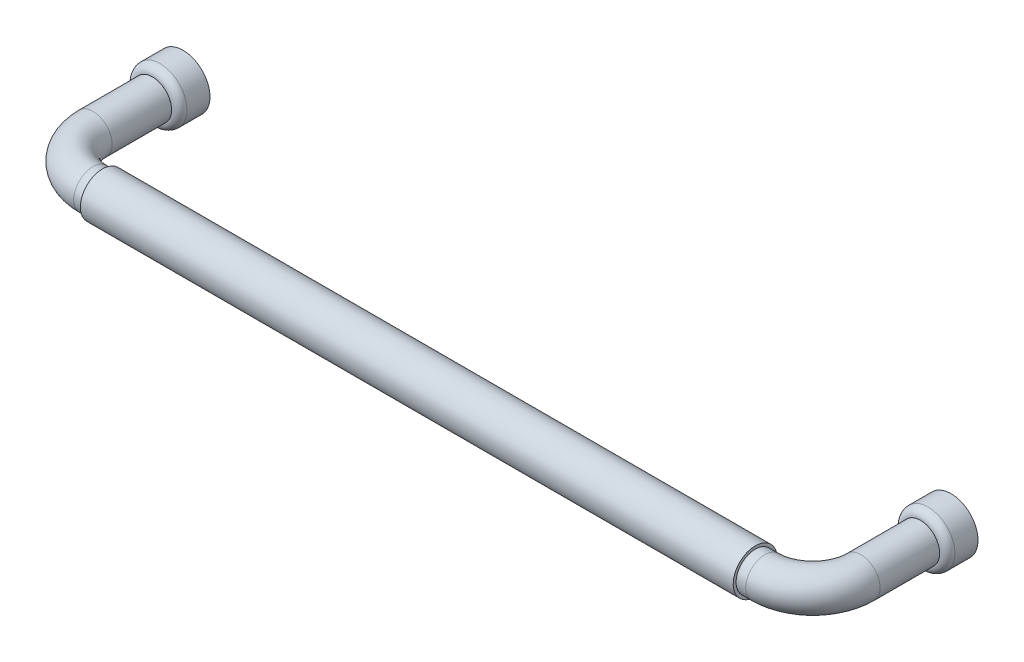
ISO-10303-21;
HEADER;
FILE_DESCRIPTION(('STEP AP214'),'2;1');
FILE_NAME('part.step','',(''),(''),'','','');
FILE_SCHEMA(('AUTOMOTIVE_DESIGN { 1 0 10303 214 1 1 1 1 }'));
ENDSEC;
DATA;
#1=APPLICATION_CONTEXT('core data for automotive mechanical design processes');
#2=APPLICATION_PROTOCOL_DEFINITION('international standard','automotive_design',2000,#1);
#3=PRODUCT_CONTEXT('',#1,'mechanical');
#4=PRODUCT('Part','Part','',(#3));
#5=PRODUCT_RELATED_PRODUCT_CATEGORY('part','',(#4));
#6=PRODUCT_DEFINITION_FORMATION('','',#4);
#7=PRODUCT_DEFINITION_CONTEXT('part definition',#1,'design');
#8=PRODUCT_DEFINITION('design','',#6,#7);
#9=PRODUCT_DEFINITION_SHAPE('','',#8);
#10=(LENGTH_UNIT() NAMED_UNIT(*) SI_UNIT(.MILLI.,.METRE.));
#11=(NAMED_UNIT(*) PLANE_ANGLE_UNIT() SI_UNIT($,.RADIAN.));
#12=(NAMED_UNIT(*) SI_UNIT($,.STERADIAN.) SOLID_ANGLE_UNIT());
#13=UNCERTAINTY_MEASURE_WITH_UNIT(LENGTH_MEASURE(1.E-05),#10,'distance_accuracy_value','');
#14=(GEOMETRIC_REPRESENTATION_CONTEXT(3) GLOBAL_UNCERTAINTY_ASSIGNED_CONTEXT((#13)) GLOBAL_UNIT_ASSIGNED_CONTEXT((#10,
#11,#12)) REPRESENTATION_CONTEXT('',''));
#15=CARTESIAN_POINT('',(0.,0.,0.));
#16=DIRECTION('',(0.,0.,1.));
#17=DIRECTION('',(1.,0.,0.));
#18=AXIS2_PLACEMENT_3D('',#15,#16,#17);
#19=CARTESIAN_POINT('',(0.,0.,0.));
#20=DIRECTION('',(0.,0.,-1.));
#21=DIRECTION('',(0.,1.,0.));
#22=AXIS2_PLACEMENT_3D('',#19,#20,#21);
#23=PLANE('',#22);
#24=CARTESIAN_POINT('',(0.,0.,0.));
#25=DIRECTION('',(0.,0.,1.));
#26=DIRECTION('',(0.,-1.,0.));
#27=AXIS2_PLACEMENT_3D('',#24,#25,#26);
#28=CIRCLE('',#27,7.00045758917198);
#29=CARTESIAN_POINT('',(0.,-7.00045758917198,0.));
#30=VERTEX_POINT('',#29);
#31=EDGE_CURVE('E295',#30,#30,#28,.T.);
#32=ORIENTED_EDGE('',*,*,#31,.F.);
#33=EDGE_LOOP('',(#32));
#34=FACE_BOUND('',#33,.T.);
#35=CARTESIAN_POINT('',(0.,0.,0.));
#36=DIRECTION('',(0.,0.,1.));
#37=DIRECTION('',(0.,-1.,0.));
#38=AXIS2_PLACEMENT_3D('',#35,#36,#37);
#39=CIRCLE('',#38,2.5);
#40=CARTESIAN_POINT('',(0.,-2.5,0.));
#41=VERTEX_POINT('',#40);
#42=EDGE_CURVE('E285',#41,#41,#39,.T.);
#43=ORIENTED_EDGE('',*,*,#42,.T.);
#44=EDGE_LOOP('',(#43));
#45=FACE_BOUND('',#44,.T.);
#46=ADVANCED_FACE('F12',(#34,#45),#23,.T.);
#47=CARTESIAN_POINT('',(187.5,0.,36.));
#48=DIRECTION('',(-1.,0.,0.));
#49=DIRECTION('',(0.,0.,1.));
#50=AXIS2_PLACEMENT_3D('',#47,#48,#49);
#51=CYLINDRICAL_SURFACE('',#50,5.);
#52=CARTESIAN_POINT('',(185.,0.,36.));
#53=DIRECTION('',(1.,0.,0.));
#54=DIRECTION('',(0.,1.,0.));
#55=AXIS2_PLACEMENT_3D('',#52,#53,#54);
#56=CIRCLE('',#55,5.);
#57=CARTESIAN_POINT('',(185.,5.,36.));
#58=VERTEX_POINT('',#57);
#59=EDGE_CURVE('E19',#58,#58,#56,.F.);
#60=ORIENTED_EDGE('',*,*,#59,.F.);
#61=EDGE_LOOP('',(#60));
#62=FACE_BOUND('',#61,.T.);
#63=CARTESIAN_POINT('',(187.5,0.,36.));
#64=DIRECTION('',(-1.,0.,0.));
#65=DIRECTION('',(0.,1.,0.));
#66=AXIS2_PLACEMENT_3D('',#63,#64,#65);
#67=CIRCLE('',#66,5.);
#68=CARTESIAN_POINT('',(187.5,0.,41.));
#69=VERTEX_POINT('',#68);
#70=EDGE_CURVE('E55',#69,#69,#67,.T.);
#71=ORIENTED_EDGE('',*,*,#70,.T.);
#72=EDGE_LOOP('',(#71));
#73=FACE_BOUND('',#72,.T.);
#74=ADVANCED_FACE('F77',(#62,#73),#51,.T.);
#75=CARTESIAN_POINT('',(187.5,0.,23.5));
#76=DIRECTION('',(0.,-1.,0.));
#77=DIRECTION('',(1.,0.,0.));
#78=AXIS2_PLACEMENT_3D('',#75,#76,#77);
#79=TOROIDAL_SURFACE('',#78,12.5,5.);
#80=CARTESIAN_POINT('',(200.,0.,23.5));
#81=DIRECTION('',(0.,0.,1.));
#82=DIRECTION('',(0.,1.,0.));
#83=AXIS2_PLACEMENT_3D('',#80,#81,#82);
#84=CIRCLE('',#83,5.);
#85=CARTESIAN_POINT('',(205.,0.,23.5));
#86=VERTEX_POINT('',#85);
#87=EDGE_CURVE('E52',#86,#86,#84,.T.);
#88=CARTESIAN_POINT('',(187.5,0.,23.5));
#89=DIRECTION('',(0.,-1.,0.));
#90=DIRECTION('',(1.,0.,0.));
#91=AXIS2_PLACEMENT_3D('',#88,#89,#90);
#92=CIRCLE('',#91,17.5);
#93=EDGE_CURVE('',#86,#69,#92,.T.);
#94=ORIENTED_EDGE('',*,*,#87,.T.);
#95=ORIENTED_EDGE('',*,*,#70,.F.);
#96=ORIENTED_EDGE('',*,*,#93,.T.);
#97=ORIENTED_EDGE('',*,*,#93,.F.);
#98=EDGE_LOOP('',(#94,#96,#95,#97));
#99=FACE_BOUND('',#98,.T.);
#100=ADVANCED_FACE('F87',(#99),#79,.T.);
#101=CARTESIAN_POINT('',(200.,0.,23.5));
#102=DIRECTION('',(0.,0.,-1.));
#103=DIRECTION('',(0.,-1.,0.));
#104=AXIS2_PLACEMENT_3D('',#101,#102,#103);
#105=CYLINDRICAL_SURFACE('',#104,5.);
#106=CARTESIAN_POINT('',(200.,0.,7.99921137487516));
#107=DIRECTION('',(0.,0.,1.));
#108=DIRECTION('',(0.,1.,0.));
#109=AXIS2_PLACEMENT_3D('',#106,#107,#108);
#110=CIRCLE('',#109,5.);
#111=CARTESIAN_POINT('',(200.,5.,7.99921137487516));
#112=VERTEX_POINT('',#111);
#113=EDGE_CURVE('E31',#112,#112,#110,.T.);
#114=ORIENTED_EDGE('',*,*,#113,.T.);
#115=EDGE_LOOP('',(#114));
#116=FACE_BOUND('',#115,.T.);
#117=ORIENTED_EDGE('',*,*,#87,.F.);
#118=EDGE_LOOP('',(#117));
#119=FACE_BOUND('',#118,.T.);
#120=ADVANCED_FACE('F95',(#116,#119),#105,.T.);
#121=CARTESIAN_POINT('',(185.,0.,36.));
#122=DIRECTION('',(1.,0.,0.));
#123=DIRECTION('',(0.,1.,0.));
#124=AXIS2_PLACEMENT_3D('',#121,#122,#123);
#125=PLANE('',#124);
#126=ORIENTED_EDGE('',*,*,#59,.T.);
#127=EDGE_LOOP('',(#126));
#128=FACE_BOUND('',#127,.T.);
#129=CARTESIAN_POINT('',(185.,0.,36.));
#130=DIRECTION('',(1.,0.,0.));
#131=DIRECTION('',(0.,1.,0.));
#132=AXIS2_PLACEMENT_3D('',#129,#130,#131);
#133=CIRCLE('',#132,5.75);
#134=CARTESIAN_POINT('',(185.,5.75,36.));
#135=VERTEX_POINT('',#134);
#136=EDGE_CURVE('E38',#135,#135,#133,.T.);
#137=ORIENTED_EDGE('',*,*,#136,.T.);
#138=EDGE_LOOP('',(#137));
#139=FACE_BOUND('',#138,.T.);
#140=ADVANCED_FACE('F98',(#128,#139),#125,.T.);
#141=CARTESIAN_POINT('',(115.885269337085,0.,36.));
#142=DIRECTION('',(1.,0.,0.));
#143=DIRECTION('',(0.,1.,0.));
#144=AXIS2_PLACEMENT_3D('',#141,#142,#143);
#145=CYLINDRICAL_SURFACE('',#144,5.75);
#146=ORIENTED_EDGE('',*,*,#136,.F.);
#147=EDGE_LOOP('',(#146));
#148=FACE_BOUND('',#147,.T.);
#149=CARTESIAN_POINT('',(15.,0.,36.));
#150=DIRECTION('',(1.,0.,0.));
#151=DIRECTION('',(0.,1.,0.));
#152=AXIS2_PLACEMENT_3D('',#149,#150,#151);
#153=CIRCLE('',#152,5.75);
#154=CARTESIAN_POINT('',(15.,5.75,36.));
#155=VERTEX_POINT('',#154);
#156=EDGE_CURVE('E33',#155,#155,#153,.T.);
#157=ORIENTED_EDGE('',*,*,#156,.T.);
#158=EDGE_LOOP('',(#157));
#159=FACE_BOUND('',#158,.T.);
#160=ADVANCED_FACE('F127',(#148,#159),#145,.T.);
#161=CARTESIAN_POINT('',(15.,0.,41.75));
#162=DIRECTION('',(-1.,0.,0.));
#163=DIRECTION('',(0.,-1.,0.));
#164=AXIS2_PLACEMENT_3D('',#161,#162,#163);
#165=PLANE('',#164);
#166=CARTESIAN_POINT('',(15.,0.,36.));
#167=DIRECTION('',(-1.,0.,0.));
#168=DIRECTION('',(0.,-1.,0.));
#169=AXIS2_PLACEMENT_3D('',#166,#167,#168);
#170=CIRCLE('',#169,5.);
#171=CARTESIAN_POINT('',(15.,-5.,36.));
#172=VERTEX_POINT('',#171);
#173=EDGE_CURVE('E23',#172,#172,#170,.F.);
#174=ORIENTED_EDGE('',*,*,#173,.T.);
#175=EDGE_LOOP('',(#174));
#176=FACE_BOUND('',#175,.T.);
#177=ORIENTED_EDGE('',*,*,#156,.F.);
#178=EDGE_LOOP('',(#177));
#179=FACE_BOUND('',#178,.T.);
#180=ADVANCED_FACE('F78',(#176,#179),#165,.T.);
#181=CARTESIAN_POINT('',(0.,0.,23.5));
#182=DIRECTION('',(0.,0.,-1.));
#183=DIRECTION('',(0.,-1.,0.));
#184=AXIS2_PLACEMENT_3D('',#181,#182,#183);
#185=CYLINDRICAL_SURFACE('',#184,5.);
#186=CARTESIAN_POINT('',(0.,0.,7.99921137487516));
#187=DIRECTION('',(0.,0.,1.));
#188=DIRECTION('',(0.,1.,0.));
#189=AXIS2_PLACEMENT_3D('',#186,#187,#188);
#190=CIRCLE('',#189,5.);
#191=CARTESIAN_POINT('',(0.,5.,7.99921137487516));
#192=VERTEX_POINT('',#191);
#193=EDGE_CURVE('E8',#192,#192,#190,.F.);
#194=ORIENTED_EDGE('',*,*,#193,.F.);
#195=EDGE_LOOP('',(#194));
#196=FACE_BOUND('',#195,.T.);
#197=CARTESIAN_POINT('',(0.,0.,23.5));
#198=DIRECTION('',(0.,0.,-1.));
#199=DIRECTION('',(0.,1.,0.));
#200=AXIS2_PLACEMENT_3D('',#197,#198,#199);
#201=CIRCLE('',#200,5.);
#202=CARTESIAN_POINT('',(-5.,0.,23.5));
#203=VERTEX_POINT('',#202);
#204=EDGE_CURVE('E28',#203,#203,#201,.T.);
#205=ORIENTED_EDGE('',*,*,#204,.T.);
#206=EDGE_LOOP('',(#205));
#207=FACE_BOUND('',#206,.T.);
#208=ADVANCED_FACE('F14',(#196,#207),#185,.T.);
#209=CARTESIAN_POINT('',(12.5,0.,23.5));
#210=DIRECTION('',(0.,-1.,0.));
#211=DIRECTION('',(1.,0.,0.));
#212=AXIS2_PLACEMENT_3D('',#209,#210,#211);
#213=TOROIDAL_SURFACE('',#212,12.5,5.);
#214=CARTESIAN_POINT('',(12.5,0.,36.));
#215=DIRECTION('',(-1.,0.,0.));
#216=DIRECTION('',(0.,1.,0.));
#217=AXIS2_PLACEMENT_3D('',#214,#215,#216);
#218=CIRCLE('',#217,5.);
#219=CARTESIAN_POINT('',(12.5,0.,41.));
#220=VERTEX_POINT('',#219);
#221=EDGE_CURVE('E58',#220,#220,#218,.T.);
#222=CARTESIAN_POINT('',(12.5,0.,23.5));
#223=DIRECTION('',(0.,-1.,0.));
#224=DIRECTION('',(1.,0.,0.));
#225=AXIS2_PLACEMENT_3D('',#222,#223,#224);
#226=CIRCLE('',#225,17.5);
#227=EDGE_CURVE('',#220,#203,#226,.T.);
#228=ORIENTED_EDGE('',*,*,#221,.T.);
#229=ORIENTED_EDGE('',*,*,#204,.F.);
#230=ORIENTED_EDGE('',*,*,#227,.T.);
#231=ORIENTED_EDGE('',*,*,#227,.F.);
#232=EDGE_LOOP('',(#228,#230,#229,#231));
#233=FACE_BOUND('',#232,.T.);
#234=ADVANCED_FACE('F64',(#233),#213,.T.);
#235=ORIENTED_EDGE('',*,*,#173,.F.);
#236=EDGE_LOOP('',(#235));
#237=FACE_BOUND('',#236,.T.);
#238=ORIENTED_EDGE('',*,*,#221,.F.);
#239=EDGE_LOOP('',(#238));
#240=FACE_BOUND('',#239,.T.);
#241=ADVANCED_FACE('F66',(#237,#240),#51,.T.);
#242=CARTESIAN_POINT('',(194.999542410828,0.,7.99921137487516));
#243=DIRECTION('',(0.,0.,1.));
#244=DIRECTION('',(0.,1.,0.));
#245=AXIS2_PLACEMENT_3D('',#242,#243,#244);
#246=PLANE('',#245);
#247=CARTESIAN_POINT('',(200.,0.,7.99921137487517));
#248=DIRECTION('',(0.,0.,-1.));
#249=DIRECTION('',(0.,-1.,0.));
#250=AXIS2_PLACEMENT_3D('',#247,#248,#249);
#251=CIRCLE('',#250,5.00045758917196);
#252=CARTESIAN_POINT('',(200.,-5.00045758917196,7.99921137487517));
#253=VERTEX_POINT('',#252);
#254=EDGE_CURVE('E46',#253,#253,#251,.T.);
#255=ORIENTED_EDGE('',*,*,#254,.F.);
#256=EDGE_LOOP('',(#255));
#257=FACE_BOUND('',#256,.T.);
#258=ORIENTED_EDGE('',*,*,#113,.F.);
#259=EDGE_LOOP('',(#258));
#260=FACE_BOUND('',#259,.T.);
#261=ADVANCED_FACE('F74',(#257,#260),#246,.T.);
#262=CARTESIAN_POINT('',(200.,0.,0.));
#263=DIRECTION('',(0.,0.,-1.));
#264=DIRECTION('',(0.,-1.,0.));
#265=AXIS2_PLACEMENT_3D('',#262,#263,#264);
#266=CYLINDRICAL_SURFACE('',#265,7.00045758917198);
#267=CARTESIAN_POINT('',(200.,0.,5.99921137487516));
#268=DIRECTION('',(0.,0.,-1.));
#269=DIRECTION('',(0.,-1.,0.));
#270=AXIS2_PLACEMENT_3D('',#267,#268,#269);
#271=CIRCLE('',#270,7.00045758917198);
#272=CARTESIAN_POINT('',(200.,-7.00045758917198,5.99921137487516));
#273=VERTEX_POINT('',#272);
#274=EDGE_CURVE('E41',#273,#273,#271,.T.);
#275=ORIENTED_EDGE('',*,*,#274,.T.);
#276=EDGE_LOOP('',(#275));
#277=FACE_BOUND('',#276,.T.);
#278=CARTESIAN_POINT('',(200.,0.,0.));
#279=DIRECTION('',(0.,0.,-1.));
#280=DIRECTION('',(0.,-1.,0.));
#281=AXIS2_PLACEMENT_3D('',#278,#279,#280);
#282=CIRCLE('',#281,7.00045758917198);
#283=CARTESIAN_POINT('',(200.,-7.00045758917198,0.));
#284=VERTEX_POINT('',#283);
#285=EDGE_CURVE('E34',#284,#284,#282,.T.);
#286=ORIENTED_EDGE('',*,*,#285,.F.);
#287=EDGE_LOOP('',(#286));
#288=FACE_BOUND('',#287,.T.);
#289=ADVANCED_FACE('F181',(#277,#288),#266,.T.);
#290=CARTESIAN_POINT('',(200.,0.,5.99921137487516));
#291=DIRECTION('',(0.,0.,-1.));
#292=DIRECTION('',(0.,-1.,0.));
#293=AXIS2_PLACEMENT_3D('',#290,#291,#292);
#294=TOROIDAL_SURFACE('',#293,5.00045758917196,2.);
#295=ORIENTED_EDGE('',*,*,#254,.T.);
#296=EDGE_LOOP('',(#295));
#297=FACE_BOUND('',#296,.T.);
#298=ORIENTED_EDGE('',*,*,#274,.F.);
#299=EDGE_LOOP('',(#298));
#300=FACE_BOUND('',#299,.T.);
#301=ADVANCED_FACE('F189',(#297,#300),#294,.T.);
#302=CARTESIAN_POINT('',(200.,0.,0.));
#303=DIRECTION('',(0.,0.,1.));
#304=DIRECTION('',(0.,1.,0.));
#305=AXIS2_PLACEMENT_3D('',#302,#303,#304);
#306=PLANE('',#305);
#307=CARTESIAN_POINT('',(200.,0.,0.));
#308=DIRECTION('',(0.,0.,-1.));
#309=DIRECTION('',(0.,-1.,0.));
#310=AXIS2_PLACEMENT_3D('',#307,#308,#309);
#311=CIRCLE('',#310,2.5);
#312=CARTESIAN_POINT('',(200.,-2.5,0.));
#313=VERTEX_POINT('',#312);
#314=EDGE_CURVE('E298',#313,#313,#311,.T.);
#315=ORIENTED_EDGE('',*,*,#314,.F.);
#316=EDGE_LOOP('',(#315));
#317=FACE_BOUND('',#316,.T.);
#318=ORIENTED_EDGE('',*,*,#285,.T.);
#319=EDGE_LOOP('',(#318));
#320=FACE_BOUND('',#319,.T.);
#321=ADVANCED_FACE('F93',(#317,#320),#306,.F.);
#322=CARTESIAN_POINT('',(200.,0.,11.));
#323=DIRECTION('',(0.,0.,-1.));
#324=DIRECTION('',(0.,-1.,0.));
#325=AXIS2_PLACEMENT_3D('',#322,#323,#324);
#326=CYLINDRICAL_SURFACE('',#325,2.5);
#327=CARTESIAN_POINT('',(200.,0.,11.));
#328=DIRECTION('',(0.,0.,-1.));
#329=DIRECTION('',(0.,-1.,0.));
#330=AXIS2_PLACEMENT_3D('',#327,#328,#329);
#331=CIRCLE('',#330,2.5);
#332=CARTESIAN_POINT('',(200.,-2.5,11.));
#333=VERTEX_POINT('',#332);
#334=EDGE_CURVE('E301',#333,#333,#331,.T.);
#335=ORIENTED_EDGE('',*,*,#334,.F.);
#336=EDGE_LOOP('',(#335));
#337=FACE_BOUND('',#336,.T.);
#338=ORIENTED_EDGE('',*,*,#314,.T.);
#339=EDGE_LOOP('',(#338));
#340=FACE_BOUND('',#339,.T.);
#341=ADVANCED_FACE('F206',(#337,#340),#326,.F.);
#342=CARTESIAN_POINT('',(200.,0.,11.));
#343=DIRECTION('',(0.,0.,-1.));
#344=DIRECTION('',(0.,-1.,0.));
#345=AXIS2_PLACEMENT_3D('',#342,#343,#344);
#346=PLANE('',#345);
#347=ORIENTED_EDGE('',*,*,#334,.T.);
#348=EDGE_LOOP('',(#347));
#349=FACE_BOUND('',#348,.T.);
#350=ADVANCED_FACE('F208',(#349),#346,.T.);
#351=CARTESIAN_POINT('',(0.,0.,0.));
#352=DIRECTION('',(0.,0.,-1.));
#353=DIRECTION('',(0.,-1.,0.));
#354=AXIS2_PLACEMENT_3D('',#351,#352,#353);
#355=CYLINDRICAL_SURFACE('',#354,7.00045758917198);
#356=CARTESIAN_POINT('',(0.,0.,5.99921137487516));
#357=DIRECTION('',(0.,0.,1.));
#358=DIRECTION('',(0.,-1.,0.));
#359=AXIS2_PLACEMENT_3D('',#356,#357,#358);
#360=CIRCLE('',#359,7.00045758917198);
#361=CARTESIAN_POINT('',(0.,-7.00045758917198,5.99921137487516));
#362=VERTEX_POINT('',#361);
#363=EDGE_CURVE('E288',#362,#362,#360,.T.);
#364=ORIENTED_EDGE('',*,*,#363,.F.);
#365=EDGE_LOOP('',(#364));
#366=FACE_BOUND('',#365,.T.);
#367=ORIENTED_EDGE('',*,*,#31,.T.);
#368=EDGE_LOOP('',(#367));
#369=FACE_BOUND('',#368,.T.);
#370=ADVANCED_FACE('F217',(#366,#369),#355,.T.);
#371=CARTESIAN_POINT('',(0.,0.,5.99921137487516));
#372=DIRECTION('',(0.,0.,-1.));
#373=DIRECTION('',(0.,-1.,0.));
#374=AXIS2_PLACEMENT_3D('',#371,#372,#373);
#375=TOROIDAL_SURFACE('',#374,5.00045758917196,2.);
#376=CARTESIAN_POINT('',(0.,0.,7.99921137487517));
#377=DIRECTION('',(0.,0.,1.));
#378=DIRECTION('',(0.,-1.,0.));
#379=AXIS2_PLACEMENT_3D('',#376,#377,#378);
#380=CIRCLE('',#379,5.00045758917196);
#381=CARTESIAN_POINT('',(0.,-5.00045758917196,7.99921137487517));
#382=VERTEX_POINT('',#381);
#383=EDGE_CURVE('E284',#382,#382,#380,.T.);
#384=ORIENTED_EDGE('',*,*,#383,.F.);
#385=EDGE_LOOP('',(#384));
#386=FACE_BOUND('',#385,.T.);
#387=ORIENTED_EDGE('',*,*,#363,.T.);
#388=EDGE_LOOP('',(#387));
#389=FACE_BOUND('',#388,.T.);
#390=ADVANCED_FACE('F232',(#386,#389),#375,.T.);
#391=CARTESIAN_POINT('',(5.000457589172,0.,7.99921137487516));
#392=DIRECTION('',(0.,0.,1.));
#393=DIRECTION('',(0.,1.,0.));
#394=AXIS2_PLACEMENT_3D('',#391,#392,#393);
#395=PLANE('',#394);
#396=ORIENTED_EDGE('',*,*,#193,.T.);
#397=EDGE_LOOP('',(#396));
#398=FACE_BOUND('',#397,.T.);
#399=ORIENTED_EDGE('',*,*,#383,.T.);
#400=EDGE_LOOP('',(#399));
#401=FACE_BOUND('',#400,.T.);
#402=ADVANCED_FACE('F241',(#398,#401),#395,.T.);
#403=CARTESIAN_POINT('',(0.,0.,11.));
#404=DIRECTION('',(0.,0.,-1.));
#405=DIRECTION('',(0.,-1.,0.));
#406=AXIS2_PLACEMENT_3D('',#403,#404,#405);
#407=CYLINDRICAL_SURFACE('',#406,2.5);
#408=CARTESIAN_POINT('',(0.,0.,11.));
#409=DIRECTION('',(0.,0.,1.));
#410=DIRECTION('',(0.,-1.,0.));
#411=AXIS2_PLACEMENT_3D('',#408,#409,#410);
#412=CIRCLE('',#411,2.5);
#413=CARTESIAN_POINT('',(0.,-2.5,11.));
#414=VERTEX_POINT('',#413);
#415=EDGE_CURVE('E283',#414,#414,#412,.T.);
#416=ORIENTED_EDGE('',*,*,#415,.T.);
#417=EDGE_LOOP('',(#416));
#418=FACE_BOUND('',#417,.T.);
#419=ORIENTED_EDGE('',*,*,#42,.F.);
#420=EDGE_LOOP('',(#419));
#421=FACE_BOUND('',#420,.T.);
#422=ADVANCED_FACE('F250',(#418,#421),#407,.F.);
#423=CARTESIAN_POINT('',(0.,0.,11.));
#424=DIRECTION('',(0.,0.,-1.));
#425=DIRECTION('',(0.,-1.,0.));
#426=AXIS2_PLACEMENT_3D('',#423,#424,#425);
#427=PLANE('',#426);
#428=ORIENTED_EDGE('',*,*,#415,.F.);
#429=EDGE_LOOP('',(#428));
#430=FACE_BOUND('',#429,.T.);
#431=ADVANCED_FACE('F252',(#430),#427,.T.);
#432=CLOSED_SHELL('',(#46,#74,#100,#120,#140,#160,#180,#208,#234,#241,#261,#289,#301,#321,#341,
#350,#370,#390,#402,#422,#431));
#433=MANIFOLD_SOLID_BREP('B1',#432);
#434=ADVANCED_BREP_SHAPE_REPRESENTATION('',(#18,#433),#14);
#435=SHAPE_DEFINITION_REPRESENTATION(#9,#434);
ENDSEC;
END-ISO-10303-21;
